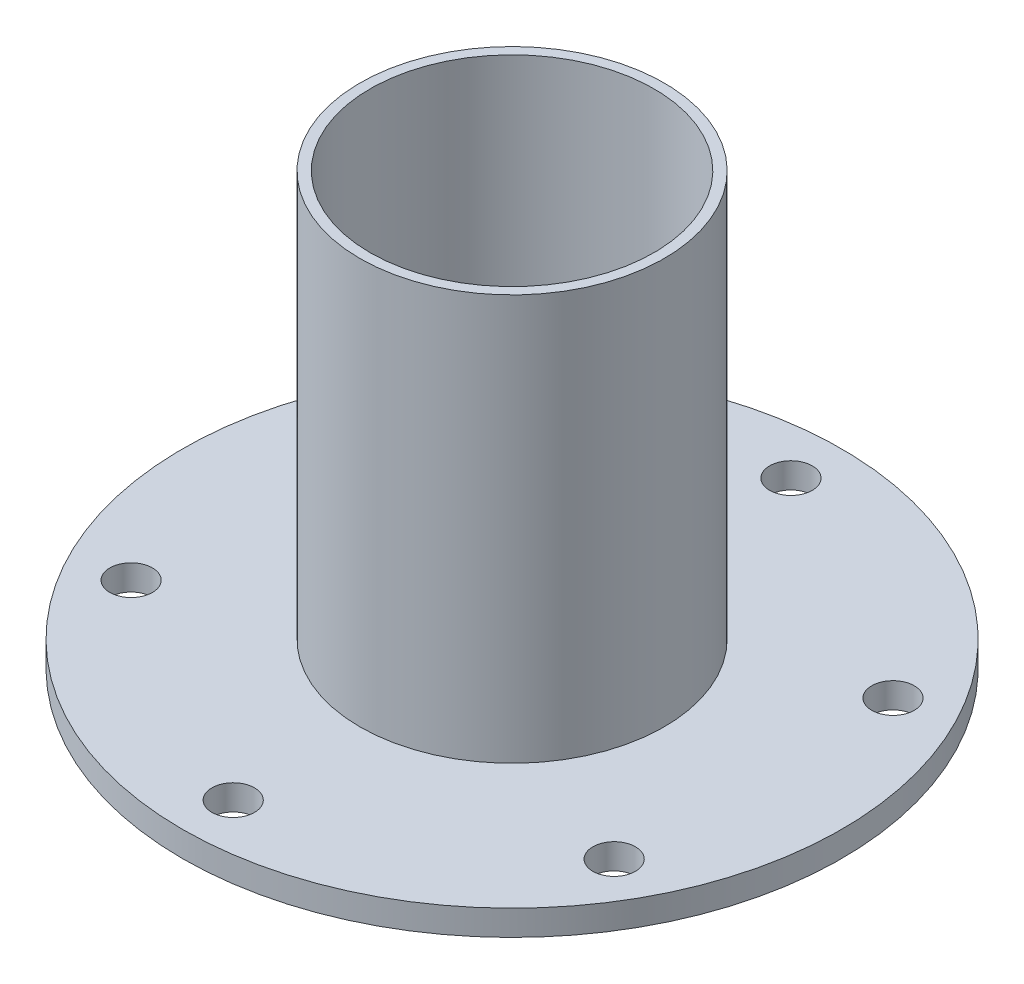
from build123d import *

# Parameters (mm, degrees)
SKETCH1_R           = 41.275
SKETCH1_R_2         = 2.667
BOSS_EXTRUDE1_DEPTH = 3.175
SKETCH2_R           = 19.05
SKETCH2_R_2         = 17.78
BOSS_EXTRUDE2_DEPTH = 50.8


with BuildPart() as part:
    # Sketch1 → Boss-Extrude1 (new body)
    with BuildSketch(Plane(origin=(0, 0, 0), x_dir=(1, 0, 0), z_dir=(0, 1, 0))):
        with Locations(Location((0, 0, 0), (0, 0, 270))):
            Circle(SKETCH1_R)
        with Locations(Location((0, 34.925, 0), (0, 0, 270))):
            Circle(SKETCH1_R_2, mode=Mode.SUBTRACT)
        with Locations(Location((30.245937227, 17.4625, 0), (0, 0, 270))):
            Circle(SKETCH1_R_2, mode=Mode.SUBTRACT)
        with Locations(Location((30.245937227, -17.4625, 0), (0, 0, 270))):
            Circle(SKETCH1_R_2, mode=Mode.SUBTRACT)
        with Locations(Location((0, -34.925, 0), (0, 0, 270))):
            Circle(SKETCH1_R_2, mode=Mode.SUBTRACT)
        with Locations(Location((-30.245937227, -17.4625, 0), (0, 0, 270))):
            Circle(SKETCH1_R_2, mode=Mode.SUBTRACT)
        with Locations(Location((-30.245937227, 17.4625, 0), (0, 0, 270))):
            Circle(SKETCH1_R_2, mode=Mode.SUBTRACT)
    extrude(amount=BOSS_EXTRUDE1_DEPTH)

    # Sketch2 → Boss-Extrude2 (add)
    with BuildSketch(Plane(origin=(0, 3.175, 0), x_dir=(1, 0, 0), z_dir=(0, 1, 0))):
        with Locations(Location((0, 0, 0), (0, 0, 270))):
            Circle(SKETCH2_R)
        with Locations(Location((0, 0, 0), (0, 0, 270))):
            Circle(SKETCH2_R_2, mode=Mode.SUBTRACT)
    extrude(amount=BOSS_EXTRUDE2_DEPTH)


solid = part.part
